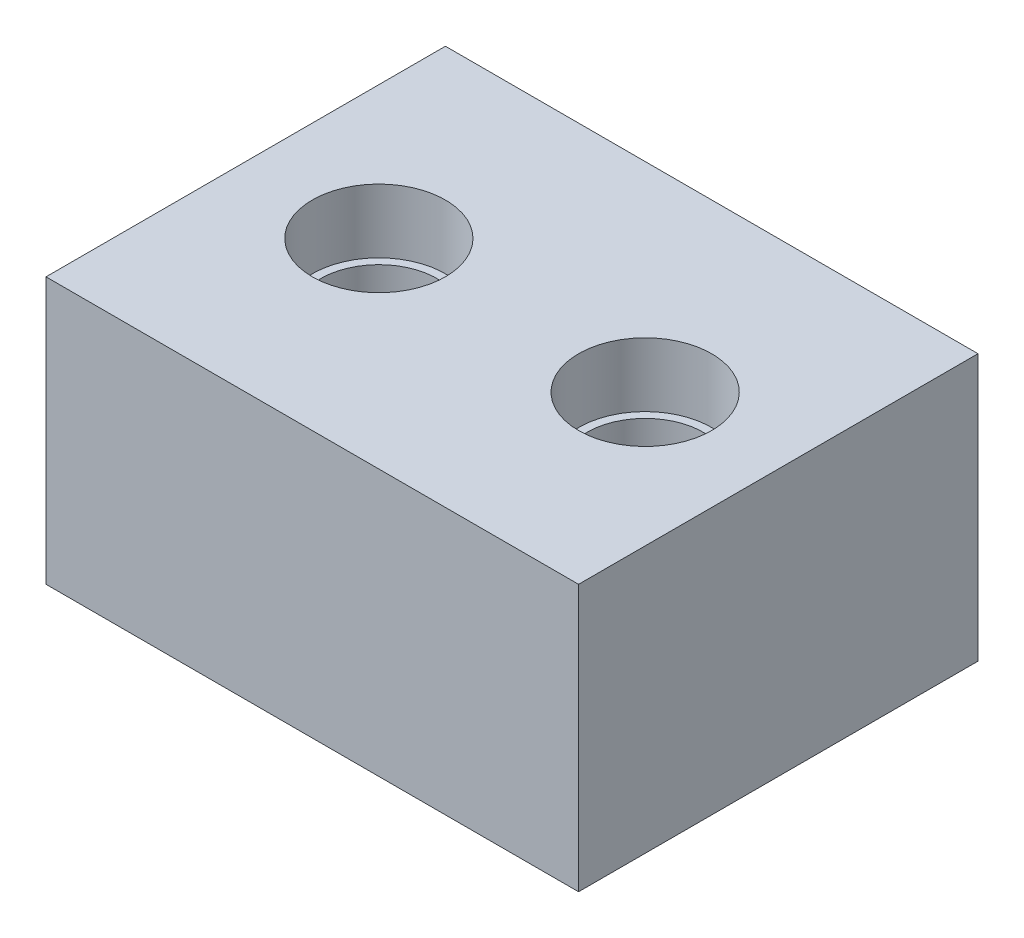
from build123d import *

# Parameters (mm, degrees)
SKETCH1_W                                        = 50.8
SKETCH1_H                                        = 38.1
BOSS_EXTRUDE1_DEPTH                              = 25.4
SKETCH2_R                                        = 6.35
CUT_EXTRUDE1_DEPTH                               = 6.096
CBORE_FOR_1_4_SOCKET_HEAD_CAP_SCREW1_D           = 7.14248
CBORE_FOR_1_4_SOCKET_HEAD_CAP_SCREW1_CBORE_D     = 11.1125
CBORE_FOR_1_4_SOCKET_HEAD_CAP_SCREW1_CBORE_DEPTH = 6.35


with BuildPart() as part:
    # Sketch1 → Boss-Extrude1 (new body)
    with BuildSketch(Plane(origin=(0, 0, 0), x_dir=(1, 0, 0), z_dir=(0, 1, 0))):
        Rectangle(SKETCH1_W, SKETCH1_H)
    extrude(amount=BOSS_EXTRUDE1_DEPTH)

    # Sketch2 → Cut-Extrude1 (cut)
    with BuildSketch(Plane(origin=(0, 25.4, 0), x_dir=(1, 0, 0), z_dir=(0, 1, 0))):
        with Locations(Location((-12.7, 0, 0), (0, 0, 270))):
            Circle(SKETCH2_R)
        with Locations(Location((12.7, 0, 0), (0, 0, 270))):
            Circle(SKETCH2_R)
    extrude(amount=-CUT_EXTRUDE1_DEPTH, mode=Mode.SUBTRACT)

    # CBORE for 1_4 Socket Head Cap Screw1 (through all)
    with Locations(Plane(origin=(0, 19.304, 0), x_dir=(1, 0, 0), z_dir=(0, 1, 0))):
        with Locations((-12.7, 0), (12.7, 0)):
            CounterBoreHole(CBORE_FOR_1_4_SOCKET_HEAD_CAP_SCREW1_D / 2, CBORE_FOR_1_4_SOCKET_HEAD_CAP_SCREW1_CBORE_D / 2, CBORE_FOR_1_4_SOCKET_HEAD_CAP_SCREW1_CBORE_DEPTH)


solid = part.part
